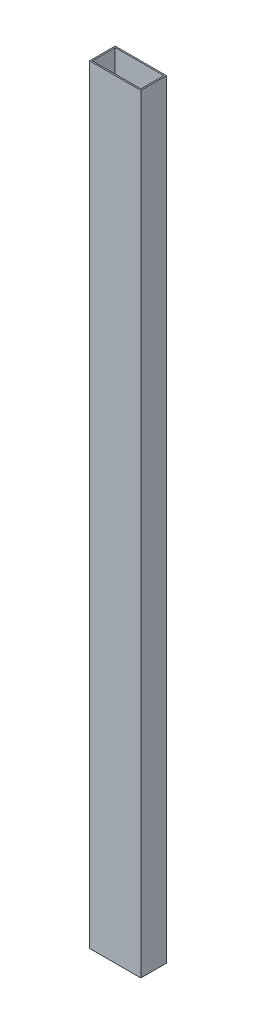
ISO-10303-21;
HEADER;
FILE_DESCRIPTION(('STEP AP214'),'2;1');
FILE_NAME('part.step','',(''),(''),'','','');
FILE_SCHEMA(('AUTOMOTIVE_DESIGN { 1 0 10303 214 1 1 1 1 }'));
ENDSEC;
DATA;
#1=APPLICATION_CONTEXT('core data for automotive mechanical design processes');
#2=APPLICATION_PROTOCOL_DEFINITION('international standard','automotive_design',2000,#1);
#3=PRODUCT_CONTEXT('',#1,'mechanical');
#4=PRODUCT('Part','Part','',(#3));
#5=PRODUCT_RELATED_PRODUCT_CATEGORY('part','',(#4));
#6=PRODUCT_DEFINITION_FORMATION('','',#4);
#7=PRODUCT_DEFINITION_CONTEXT('part definition',#1,'design');
#8=PRODUCT_DEFINITION('design','',#6,#7);
#9=PRODUCT_DEFINITION_SHAPE('','',#8);
#10=(LENGTH_UNIT() NAMED_UNIT(*) SI_UNIT(.MILLI.,.METRE.));
#11=(NAMED_UNIT(*) PLANE_ANGLE_UNIT() SI_UNIT($,.RADIAN.));
#12=(NAMED_UNIT(*) SI_UNIT($,.STERADIAN.) SOLID_ANGLE_UNIT());
#13=UNCERTAINTY_MEASURE_WITH_UNIT(LENGTH_MEASURE(1.E-05),#10,'distance_accuracy_value','');
#14=(GEOMETRIC_REPRESENTATION_CONTEXT(3) GLOBAL_UNCERTAINTY_ASSIGNED_CONTEXT((#13)) GLOBAL_UNIT_ASSIGNED_CONTEXT((#10,
#11,#12)) REPRESENTATION_CONTEXT('',''));
#15=CARTESIAN_POINT('',(0.,0.,0.));
#16=DIRECTION('',(0.,0.,1.));
#17=DIRECTION('',(1.,0.,0.));
#18=AXIS2_PLACEMENT_3D('',#15,#16,#17);
#19=CARTESIAN_POINT('',(0.,1200.,0.));
#20=DIRECTION('',(0.,1.,0.));
#21=DIRECTION('',(0.,0.,1.));
#22=AXIS2_PLACEMENT_3D('',#19,#20,#21);
#23=PLANE('',#22);
#24=DIRECTION('',(0.,0.,-1.));
#25=VECTOR('',#24,1.);
#26=CARTESIAN_POINT('',(40.,1200.,-20.));
#27=LINE('',#26,#25);
#28=CARTESIAN_POINT('',(40.,1200.,20.));
#29=VERTEX_POINT('',#28);
#30=CARTESIAN_POINT('',(40.,1200.,-20.));
#31=VERTEX_POINT('',#30);
#32=EDGE_CURVE('E153',#29,#31,#27,.T.);
#33=ORIENTED_EDGE('',*,*,#32,.T.);
#34=DIRECTION('',(-1.,0.,0.));
#35=VECTOR('',#34,1.);
#36=CARTESIAN_POINT('',(-40.,1200.,-20.));
#37=LINE('',#36,#35);
#38=CARTESIAN_POINT('',(-40.,1200.,-20.));
#39=VERTEX_POINT('',#38);
#40=EDGE_CURVE('E157',#31,#39,#37,.T.);
#41=ORIENTED_EDGE('',*,*,#40,.T.);
#42=DIRECTION('',(0.,0.,1.));
#43=VECTOR('',#42,1.);
#44=CARTESIAN_POINT('',(-40.,1200.,-20.));
#45=LINE('',#44,#43);
#46=CARTESIAN_POINT('',(-40.,1200.,20.));
#47=VERTEX_POINT('',#46);
#48=EDGE_CURVE('E161',#39,#47,#45,.T.);
#49=ORIENTED_EDGE('',*,*,#48,.T.);
#50=DIRECTION('',(1.,0.,0.));
#51=VECTOR('',#50,1.);
#52=CARTESIAN_POINT('',(-40.,1200.,20.));
#53=LINE('',#52,#51);
#54=EDGE_CURVE('E164',#47,#29,#53,.T.);
#55=ORIENTED_EDGE('',*,*,#54,.T.);
#56=EDGE_LOOP('',(#33,#41,#49,#55));
#57=FACE_BOUND('',#56,.T.);
#58=DIRECTION('',(-1.,0.,0.));
#59=VECTOR('',#58,1.);
#60=CARTESIAN_POINT('',(-38.,1200.,-18.));
#61=LINE('',#60,#59);
#62=CARTESIAN_POINT('',(38.,1200.,-18.));
#63=VERTEX_POINT('',#62);
#64=CARTESIAN_POINT('',(-38.,1200.,-18.));
#65=VERTEX_POINT('',#64);
#66=EDGE_CURVE('E114',#63,#65,#61,.T.);
#67=ORIENTED_EDGE('',*,*,#66,.F.);
#68=DIRECTION('',(0.,0.,-1.));
#69=VECTOR('',#68,1.);
#70=CARTESIAN_POINT('',(38.,1200.,-18.));
#71=LINE('',#70,#69);
#72=CARTESIAN_POINT('',(38.,1200.,18.));
#73=VERTEX_POINT('',#72);
#74=EDGE_CURVE('E105',#73,#63,#71,.T.);
#75=ORIENTED_EDGE('',*,*,#74,.F.);
#76=DIRECTION('',(1.,0.,0.));
#77=VECTOR('',#76,1.);
#78=CARTESIAN_POINT('',(-38.,1200.,18.));
#79=LINE('',#78,#77);
#80=CARTESIAN_POINT('',(-38.,1200.,18.));
#81=VERTEX_POINT('',#80);
#82=EDGE_CURVE('E131',#81,#73,#79,.T.);
#83=ORIENTED_EDGE('',*,*,#82,.F.);
#84=DIRECTION('',(0.,0.,1.));
#85=VECTOR('',#84,1.);
#86=CARTESIAN_POINT('',(-38.,1200.,-18.));
#87=LINE('',#86,#85);
#88=EDGE_CURVE('E127',#65,#81,#87,.T.);
#89=ORIENTED_EDGE('',*,*,#88,.F.);
#90=EDGE_LOOP('',(#67,#75,#83,#89));
#91=FACE_BOUND('',#90,.T.);
#92=ADVANCED_FACE('F39',(#57,#91),#23,.T.);
#93=CARTESIAN_POINT('',(0.,0.,0.));
#94=DIRECTION('',(0.,1.,0.));
#95=DIRECTION('',(0.,0.,1.));
#96=AXIS2_PLACEMENT_3D('',#93,#94,#95);
#97=PLANE('',#96);
#98=DIRECTION('',(0.,0.,-1.));
#99=VECTOR('',#98,1.);
#100=CARTESIAN_POINT('',(40.,0.,-20.));
#101=LINE('',#100,#99);
#102=CARTESIAN_POINT('',(40.,0.,20.));
#103=VERTEX_POINT('',#102);
#104=CARTESIAN_POINT('',(40.,0.,-20.));
#105=VERTEX_POINT('',#104);
#106=EDGE_CURVE('E123',#103,#105,#101,.T.);
#107=ORIENTED_EDGE('',*,*,#106,.F.);
#108=DIRECTION('',(1.,0.,0.));
#109=VECTOR('',#108,1.);
#110=CARTESIAN_POINT('',(-40.,0.,20.));
#111=LINE('',#110,#109);
#112=CARTESIAN_POINT('',(-40.,0.,20.));
#113=VERTEX_POINT('',#112);
#114=EDGE_CURVE('E158',#113,#103,#111,.T.);
#115=ORIENTED_EDGE('',*,*,#114,.F.);
#116=DIRECTION('',(0.,0.,1.));
#117=VECTOR('',#116,1.);
#118=CARTESIAN_POINT('',(-40.,0.,-20.));
#119=LINE('',#118,#117);
#120=CARTESIAN_POINT('',(-40.,0.,-20.));
#121=VERTEX_POINT('',#120);
#122=EDGE_CURVE('E174',#121,#113,#119,.T.);
#123=ORIENTED_EDGE('',*,*,#122,.F.);
#124=DIRECTION('',(-1.,0.,0.));
#125=VECTOR('',#124,1.);
#126=CARTESIAN_POINT('',(-40.,0.,-20.));
#127=LINE('',#126,#125);
#128=EDGE_CURVE('E171',#105,#121,#127,.T.);
#129=ORIENTED_EDGE('',*,*,#128,.F.);
#130=EDGE_LOOP('',(#107,#115,#123,#129));
#131=FACE_BOUND('',#130,.T.);
#132=DIRECTION('',(0.,0.,-1.));
#133=VECTOR('',#132,1.);
#134=CARTESIAN_POINT('',(38.,0.,-18.));
#135=LINE('',#134,#133);
#136=CARTESIAN_POINT('',(38.,0.,18.));
#137=VERTEX_POINT('',#136);
#138=CARTESIAN_POINT('',(38.,0.,-18.));
#139=VERTEX_POINT('',#138);
#140=EDGE_CURVE('E63',#137,#139,#135,.T.);
#141=ORIENTED_EDGE('',*,*,#140,.T.);
#142=DIRECTION('',(-1.,0.,0.));
#143=VECTOR('',#142,1.);
#144=CARTESIAN_POINT('',(-38.,0.,-18.));
#145=LINE('',#144,#143);
#146=CARTESIAN_POINT('',(-38.,0.,-18.));
#147=VERTEX_POINT('',#146);
#148=EDGE_CURVE('E121',#139,#147,#145,.T.);
#149=ORIENTED_EDGE('',*,*,#148,.T.);
#150=DIRECTION('',(0.,0.,1.));
#151=VECTOR('',#150,1.);
#152=CARTESIAN_POINT('',(-38.,0.,-18.));
#153=LINE('',#152,#151);
#154=CARTESIAN_POINT('',(-38.,0.,18.));
#155=VERTEX_POINT('',#154);
#156=EDGE_CURVE('E140',#147,#155,#153,.T.);
#157=ORIENTED_EDGE('',*,*,#156,.T.);
#158=DIRECTION('',(1.,0.,0.));
#159=VECTOR('',#158,1.);
#160=CARTESIAN_POINT('',(-38.,0.,18.));
#161=LINE('',#160,#159);
#162=EDGE_CURVE('E115',#155,#137,#161,.T.);
#163=ORIENTED_EDGE('',*,*,#162,.T.);
#164=EDGE_LOOP('',(#141,#149,#157,#163));
#165=FACE_BOUND('',#164,.T.);
#166=ADVANCED_FACE('F197',(#131,#165),#97,.F.);
#167=CARTESIAN_POINT('',(40.,1200.,-20.));
#168=DIRECTION('',(-1.,0.,0.));
#169=DIRECTION('',(0.,0.,1.));
#170=AXIS2_PLACEMENT_3D('',#167,#168,#169);
#171=PLANE('',#170);
#172=ORIENTED_EDGE('',*,*,#106,.T.);
#173=DIRECTION('',(0.,-1.,0.));
#174=VECTOR('',#173,1.);
#175=CARTESIAN_POINT('',(40.,1200.,-20.));
#176=LINE('',#175,#174);
#177=EDGE_CURVE('E11',#31,#105,#176,.T.);
#178=ORIENTED_EDGE('',*,*,#177,.F.);
#179=ORIENTED_EDGE('',*,*,#32,.F.);
#180=DIRECTION('',(0.,-1.,0.));
#181=VECTOR('',#180,1.);
#182=CARTESIAN_POINT('',(40.,1200.,20.));
#183=LINE('',#182,#181);
#184=EDGE_CURVE('E167',#29,#103,#183,.T.);
#185=ORIENTED_EDGE('',*,*,#184,.T.);
#186=EDGE_LOOP('',(#172,#178,#179,#185));
#187=FACE_BOUND('',#186,.T.);
#188=ADVANCED_FACE('F41',(#187),#171,.F.);
#189=CARTESIAN_POINT('',(-40.,1200.,-20.));
#190=DIRECTION('',(0.,0.,1.));
#191=DIRECTION('',(1.,0.,0.));
#192=AXIS2_PLACEMENT_3D('',#189,#190,#191);
#193=PLANE('',#192);
#194=ORIENTED_EDGE('',*,*,#128,.T.);
#195=DIRECTION('',(0.,-1.,0.));
#196=VECTOR('',#195,1.);
#197=CARTESIAN_POINT('',(-40.,1200.,-20.));
#198=LINE('',#197,#196);
#199=EDGE_CURVE('E48',#39,#121,#198,.T.);
#200=ORIENTED_EDGE('',*,*,#199,.F.);
#201=ORIENTED_EDGE('',*,*,#40,.F.);
#202=ORIENTED_EDGE('',*,*,#177,.T.);
#203=EDGE_LOOP('',(#194,#200,#201,#202));
#204=FACE_BOUND('',#203,.T.);
#205=ADVANCED_FACE('F207',(#204),#193,.F.);
#206=CARTESIAN_POINT('',(-40.,1200.,-20.));
#207=DIRECTION('',(1.,0.,0.));
#208=DIRECTION('',(0.,0.,-1.));
#209=AXIS2_PLACEMENT_3D('',#206,#207,#208);
#210=PLANE('',#209);
#211=ORIENTED_EDGE('',*,*,#122,.T.);
#212=DIRECTION('',(0.,-1.,0.));
#213=VECTOR('',#212,1.);
#214=CARTESIAN_POINT('',(-40.,1200.,20.));
#215=LINE('',#214,#213);
#216=EDGE_CURVE('E182',#47,#113,#215,.T.);
#217=ORIENTED_EDGE('',*,*,#216,.F.);
#218=ORIENTED_EDGE('',*,*,#48,.F.);
#219=ORIENTED_EDGE('',*,*,#199,.T.);
#220=EDGE_LOOP('',(#211,#217,#218,#219));
#221=FACE_BOUND('',#220,.T.);
#222=ADVANCED_FACE('F191',(#221),#210,.F.);
#223=CARTESIAN_POINT('',(-40.,1200.,20.));
#224=DIRECTION('',(0.,0.,-1.));
#225=DIRECTION('',(-1.,0.,0.));
#226=AXIS2_PLACEMENT_3D('',#223,#224,#225);
#227=PLANE('',#226);
#228=ORIENTED_EDGE('',*,*,#114,.T.);
#229=ORIENTED_EDGE('',*,*,#184,.F.);
#230=ORIENTED_EDGE('',*,*,#54,.F.);
#231=ORIENTED_EDGE('',*,*,#216,.T.);
#232=EDGE_LOOP('',(#228,#229,#230,#231));
#233=FACE_BOUND('',#232,.T.);
#234=ADVANCED_FACE('F201',(#233),#227,.F.);
#235=CARTESIAN_POINT('',(38.,1200.,-18.));
#236=DIRECTION('',(-1.,0.,0.));
#237=DIRECTION('',(0.,0.,1.));
#238=AXIS2_PLACEMENT_3D('',#235,#236,#237);
#239=PLANE('',#238);
#240=ORIENTED_EDGE('',*,*,#140,.F.);
#241=DIRECTION('',(0.,-1.,0.));
#242=VECTOR('',#241,1.);
#243=CARTESIAN_POINT('',(38.,1200.,18.));
#244=LINE('',#243,#242);
#245=EDGE_CURVE('E109',#73,#137,#244,.T.);
#246=ORIENTED_EDGE('',*,*,#245,.F.);
#247=ORIENTED_EDGE('',*,*,#74,.T.);
#248=DIRECTION('',(0.,-1.,0.));
#249=VECTOR('',#248,1.);
#250=CARTESIAN_POINT('',(38.,1200.,-18.));
#251=LINE('',#250,#249);
#252=EDGE_CURVE('E108',#63,#139,#251,.T.);
#253=ORIENTED_EDGE('',*,*,#252,.T.);
#254=EDGE_LOOP('',(#240,#246,#247,#253));
#255=FACE_BOUND('',#254,.T.);
#256=ADVANCED_FACE('F107',(#255),#239,.T.);
#257=CARTESIAN_POINT('',(-38.,1200.,-18.));
#258=DIRECTION('',(0.,0.,1.));
#259=DIRECTION('',(1.,0.,0.));
#260=AXIS2_PLACEMENT_3D('',#257,#258,#259);
#261=PLANE('',#260);
#262=ORIENTED_EDGE('',*,*,#148,.F.);
#263=ORIENTED_EDGE('',*,*,#252,.F.);
#264=ORIENTED_EDGE('',*,*,#66,.T.);
#265=DIRECTION('',(0.,-1.,0.));
#266=VECTOR('',#265,1.);
#267=CARTESIAN_POINT('',(-38.,1200.,-18.));
#268=LINE('',#267,#266);
#269=EDGE_CURVE('E124',#65,#147,#268,.T.);
#270=ORIENTED_EDGE('',*,*,#269,.T.);
#271=EDGE_LOOP('',(#262,#263,#264,#270));
#272=FACE_BOUND('',#271,.T.);
#273=ADVANCED_FACE('F118',(#272),#261,.T.);
#274=CARTESIAN_POINT('',(-38.,1200.,-18.));
#275=DIRECTION('',(1.,0.,0.));
#276=DIRECTION('',(0.,0.,-1.));
#277=AXIS2_PLACEMENT_3D('',#274,#275,#276);
#278=PLANE('',#277);
#279=ORIENTED_EDGE('',*,*,#156,.F.);
#280=ORIENTED_EDGE('',*,*,#269,.F.);
#281=ORIENTED_EDGE('',*,*,#88,.T.);
#282=DIRECTION('',(0.,-1.,0.));
#283=VECTOR('',#282,1.);
#284=CARTESIAN_POINT('',(-38.,1200.,18.));
#285=LINE('',#284,#283);
#286=EDGE_CURVE('E55',#81,#155,#285,.T.);
#287=ORIENTED_EDGE('',*,*,#286,.T.);
#288=EDGE_LOOP('',(#279,#280,#281,#287));
#289=FACE_BOUND('',#288,.T.);
#290=ADVANCED_FACE('F230',(#289),#278,.T.);
#291=CARTESIAN_POINT('',(-38.,1200.,18.));
#292=DIRECTION('',(0.,0.,-1.));
#293=DIRECTION('',(-1.,0.,0.));
#294=AXIS2_PLACEMENT_3D('',#291,#292,#293);
#295=PLANE('',#294);
#296=ORIENTED_EDGE('',*,*,#162,.F.);
#297=ORIENTED_EDGE('',*,*,#286,.F.);
#298=ORIENTED_EDGE('',*,*,#82,.T.);
#299=ORIENTED_EDGE('',*,*,#245,.T.);
#300=EDGE_LOOP('',(#296,#297,#298,#299));
#301=FACE_BOUND('',#300,.T.);
#302=ADVANCED_FACE('F234',(#301),#295,.T.);
#303=CLOSED_SHELL('',(#92,#166,#188,#205,#222,#234,#256,#273,#290,#302));
#304=MANIFOLD_SOLID_BREP('B2',#303);
#305=ADVANCED_BREP_SHAPE_REPRESENTATION('',(#18,#304),#14);
#306=SHAPE_DEFINITION_REPRESENTATION(#9,#305);
ENDSEC;
END-ISO-10303-21;
